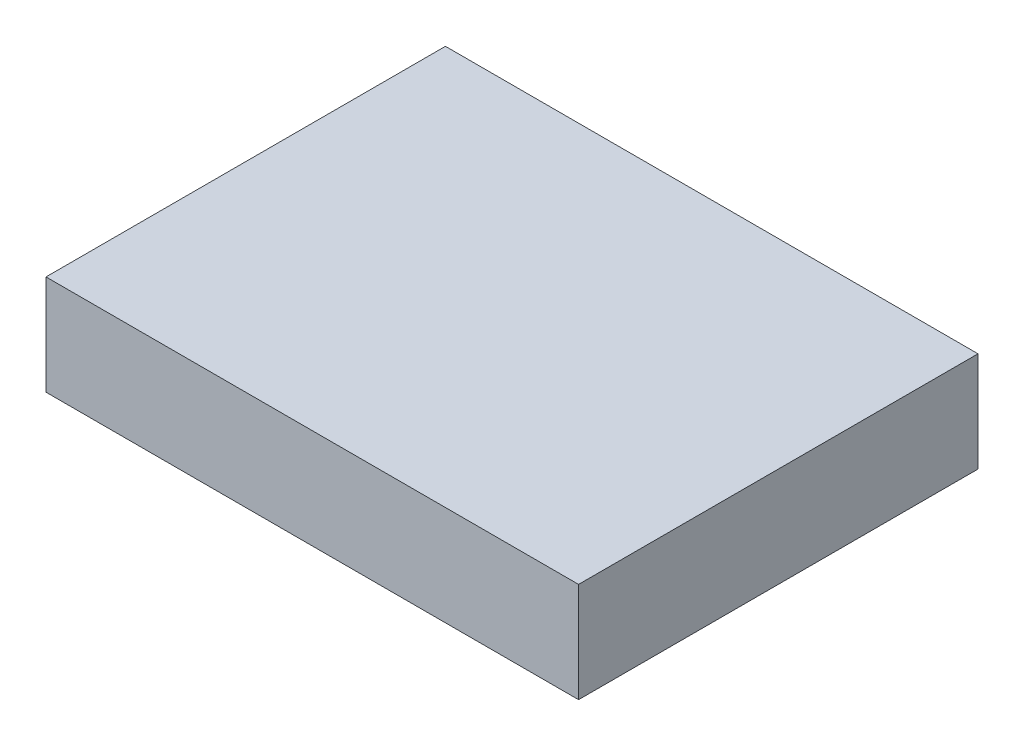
from build123d import *

# Parameters (mm, degrees)
BASESKETCH_W   = 80
BASESKETCH_H   = 60
BASEBOSS_DEPTH = 15


with BuildPart() as part:
    # BaseSketch → BaseBoss (new body)
    with BuildSketch(Plane(origin=(0, 0, 0), x_dir=(1, 0, 0), z_dir=(0, 1, 0))):
        with Locations((40, 30)):
            Rectangle(BASESKETCH_W, BASESKETCH_H)
    extrude(amount=-BASEBOSS_DEPTH)


solid = part.part
